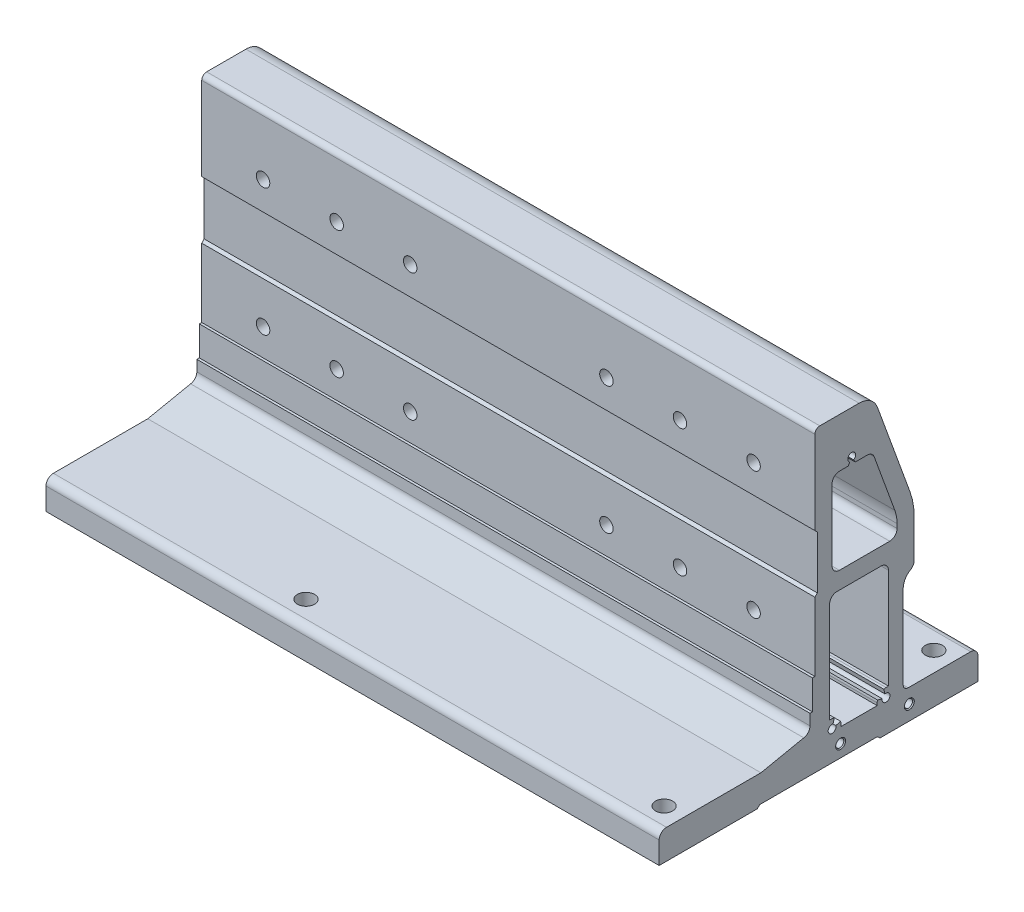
from build123d import *

# Parameters (mm, degrees)
EXTRUDE_1_DEPTH              = 125
HOLE_WIZARD_M5_1_D           = 5.5
HOLE_WIZARD_M5_1_CBORE_D     = 9.5
HOLE_WIZARD_M5_1_CBORE_DEPTH = 34.5
PATTERN_LINEAR_1_COUNT       = 2
PATTERN_LINEAR_1_PITCH       = 140
HOLE_WIZARD_M4_1_D           = 3.3
HOLE_WIZARD_M4_1_DEPTH       = 10
HOLE_WIZARD_M4_1_CSINK_D     = 4.05
HOLE_WIZARD_M4_1_CSINK_ANGLE = 90
HOLE_WIZARD_M4_1_TIP         = 0.991420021
F_5_0MM_1_D                  = 5
F_5_0MM_1_DEPTH              = 10
F_5_0MM_1_TIP                = 1.502151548
HOLE_WIZARD_7_0_7_1_D        = 7


with BuildPart() as part:
    # Sketch 2 → Extrude 1 (new, symmetric)
    with BuildSketch(Plane(origin=(0, 0, 0), x_dir=(0, 0, -1), z_dir=(1, 0, 0))):
        with BuildLine():
            Line((16.514163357, 121.5), (0.5, 121.5))
            ThreePointArc((0.5, 121.5), (-0.914213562, 120.914213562), (-1.5, 119.5))
            Line((-1.5, 119.5), (-1.5, 85.5))
            Line((-1.5, 85.5), (-0.5, 84.5))
            Line((-0.5, 84.5), (-0.5, 63))
            Line((-0.5, 63), (-1.5, 62))
            Line((-1.5, 62), (-1.5, 34))
            Line((-1.5, 34), (-2.5, 34))
            Line((-2.5, 34), (-2.5, 22))
            Line((-2.5, 22), (-3.5, 22))
            Line((-3.5, 22), (-3.5, 17.566096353))
            ThreePointArc((-3.5, 17.566096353), (-4.220229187, 15.616059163), (-6.035096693, 14.602337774))
            Line((-6.035096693, 14.602337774), (-23.5, 11))
            Line((-23.5, 11), (-62, 11))
            ThreePointArc((-62, 11), (-64.121320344, 10.121320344), (-65, 8))
            Line((-65, 8), (-65, -1))
            Line((-65, -1), (-25, -1))
            Line((-25, -1), (-24, 0))
            Line((-24, 0), (24, 0))
            Line((24, 0), (25, -1))
            Line((25, -1), (65, -1))
            Line((65, -1), (65, 8))
            ThreePointArc((65, 8), (64.121320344, 10.121320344), (62, 11))
            Line((62, 11), (36.5, 11))
            ThreePointArc((36.5, 11), (35.085786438, 11.585786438), (34.5, 13))
            Line((34.5, 13), (34.5, 47))
            ThreePointArc((34.5, 47), (35.303847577, 50), (37.5, 52.196152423))
            ThreePointArc((37.5, 52.196152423), (38.598076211, 53.294228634), (39, 54.794228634))
            Line((39, 54.794228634), (39, 69.821297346))
            ThreePointArc((39, 69.821297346), (38.54423259, 75.030742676), (37.190778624, 80.081901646))
            Line((37.190778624, 80.081901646), (24.031704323, 116.236161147))
            ThreePointArc((24.031704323, 116.236161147), (21.102774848, 120.053216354), (16.514163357, 121.5))
        make_face()
        with BuildLine():
            Line((25.5, 59.5), (7.5, 59.5))
            ThreePointArc((7.5, 59.5), (5.378679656, 58.621320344), (4.5, 56.5))
            Line((4.5, 56.5), (4.5, 15.6))
            Line((4.5, 15.6), (5.5, 15.6))
            ThreePointArc((5.5, 15.6), (5.969894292, 15.569201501), (6.431748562, 15.477332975))
            Line((6.431748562, 15.477332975), (5.914110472, 13.545481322))
            ThreePointArc((5.914110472, 13.545481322), (4.36862915, 10.86862915), (7.045481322, 12.414110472))
            Line((7.045481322, 12.414110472), (8.977332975, 12.931748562))
            ThreePointArc((8.977332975, 12.931748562), (9.069201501, 12.469894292), (9.1, 12))
            Line((9.1, 12), (9.1, 11))
            Line((9.1, 11), (23.9, 11))
            Line((23.9, 11), (23.9, 12))
            ThreePointArc((23.9, 12), (23.930798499, 12.469894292), (24.022667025, 12.931748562))
            Line((24.022667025, 12.931748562), (25.954518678, 12.414110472))
            ThreePointArc((25.954518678, 12.414110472), (28.63137085, 10.86862915), (27.085889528, 13.545481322))
            Line((27.085889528, 13.545481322), (26.568251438, 15.477332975))
            ThreePointArc((26.568251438, 15.477332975), (27.030105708, 15.569201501), (27.5, 15.6))
            Line((27.5, 15.6), (28.5, 15.6))
            Line((28.5, 15.6), (28.5, 56.5))
            ThreePointArc((28.5, 56.5), (27.621320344, 58.621320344), (25.5, 59.5))
        make_face(mode=Mode.SUBTRACT)
        with BuildLine():
            Line((12.7, 102.614356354), (12.056626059, 101.5))
            Line((12.056626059, 101.5), (8.5, 101.5))
            ThreePointArc((8.5, 101.5), (6.378679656, 100.621320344), (5.5, 98.5))
            Line((5.5, 98.5), (5.5, 69.5))
            ThreePointArc((5.5, 69.5), (6.378679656, 67.378679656), (8.5, 66.5))
            Line((8.5, 66.5), (29, 66.5))
            ThreePointArc((29, 66.5), (31.121320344, 67.378679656), (32, 69.5))
            Line((32, 69.5), (32, 71.231913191))
            ThreePointArc((32, 71.231913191), (31.772116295, 73.836635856), (31.095389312, 76.362215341))
            Line((31.095389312, 76.362215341), (22.664439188, 99.52606043))
            ThreePointArc((22.664439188, 99.52606043), (21.566090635, 100.957456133), (19.845361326, 101.5))
            Line((19.845361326, 101.5), (14.943373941, 101.5))
            Line((14.943373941, 101.5), (14.3, 102.614356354))
            ThreePointArc((14.3, 102.614356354), (13.5, 105.599997), (12.7, 102.614356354))
        make_face(mode=Mode.SUBTRACT)
    extrude(amount=EXTRUDE_1_DEPTH, both=True)

    # Hole Wizard M5 _ _ _ _ _1 (through all)
    with Locations(Plane(origin=(0, 0, -39), x_dir=(-1, 0, 0), z_dir=(0, 0, -1))):
        with Locations((-100, 97), (-70, 97), (-40, 97), (-100, 45), (-70, 45), (-40, 45)):
            hole_wizard_m5_1 = CounterBoreHole(HOLE_WIZARD_M5_1_D / 2, HOLE_WIZARD_M5_1_CBORE_D / 2, HOLE_WIZARD_M5_1_CBORE_DEPTH)

    # Pattern Linear 1: Hole Wizard M5 _ _ _ _ _1 ×2
    with Locations(*[(-i * PATTERN_LINEAR_1_PITCH, 0, 0) for i in range(1, PATTERN_LINEAR_1_COUNT)]):
        add(hole_wizard_m5_1, mode=Mode.SUBTRACT)

    # Hole Wizard M4 _ _1
    with Locations(Plane(origin=(125, 0, 0), x_dir=(0, 0, -1), z_dir=(1, 0, 0))):
        with Locations((37, 5), (9, 5)):
            CounterSinkHole(HOLE_WIZARD_M4_1_D / 2, HOLE_WIZARD_M4_1_CSINK_D / 2, depth=HOLE_WIZARD_M4_1_DEPTH, counter_sink_angle=HOLE_WIZARD_M4_1_CSINK_ANGLE)
            with Locations((0, 0, -(HOLE_WIZARD_M4_1_DEPTH + HOLE_WIZARD_M4_1_TIP / 2))):  # 118° drill point
                Cone(0, HOLE_WIZARD_M4_1_D / 2, HOLE_WIZARD_M4_1_TIP, mode=Mode.SUBTRACT)

    # 5.0mm _ _1
    with Locations(Plane(origin=(0, 0, 0), x_dir=(-1, 0, 0), z_dir=(0, -1, 0))):
        with Locations((29, 0), (-117, 0)):
            Hole(F_5_0MM_1_D / 2, depth=F_5_0MM_1_DEPTH)
            with Locations((0, 0, -(F_5_0MM_1_DEPTH + F_5_0MM_1_TIP / 2))):  # 118° drill point
                Cone(0, F_5_0MM_1_D / 2, F_5_0MM_1_TIP, mode=Mode.SUBTRACT)

    # Hole Wizard 7.0 _7_ _ _1 (through all)
    with Locations(Plane(origin=(0, -1, 0), x_dir=(-1, 0, 0), z_dir=(0, -1, 0))):
        with Locations((29, -55), (-117, -55), (29, 55), (-117, 55)):
            Hole(HOLE_WIZARD_7_0_7_1_D / 2)


solid = part.part
